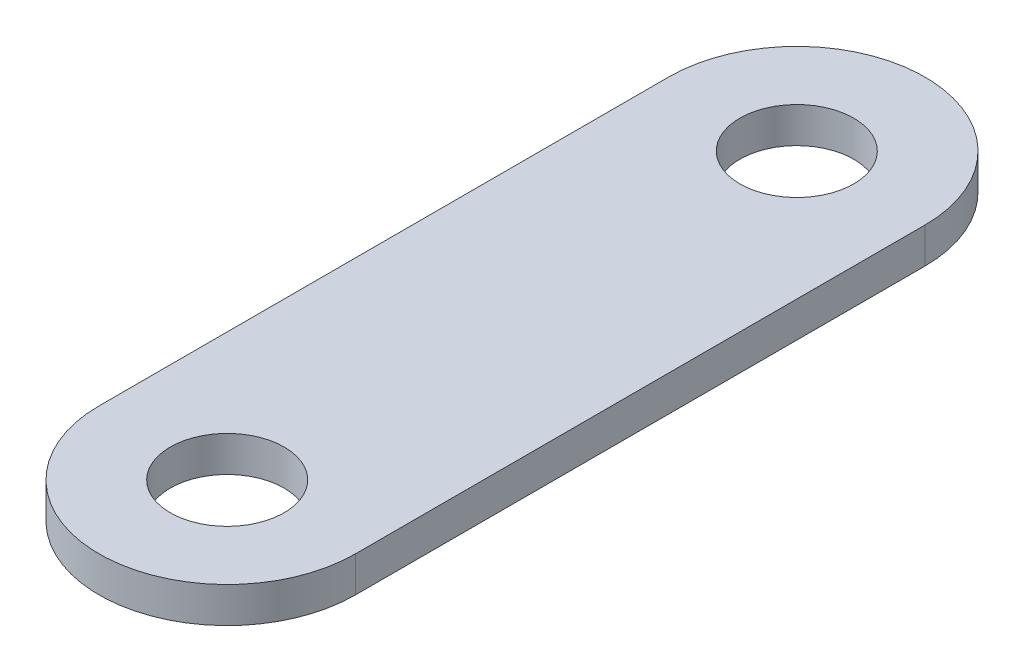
ISO-10303-21;
HEADER;
FILE_DESCRIPTION(('STEP AP214'),'2;1');
FILE_NAME('part.step','',(''),(''),'','','');
FILE_SCHEMA(('AUTOMOTIVE_DESIGN { 1 0 10303 214 1 1 1 1 }'));
ENDSEC;
DATA;
#1=APPLICATION_CONTEXT('core data for automotive mechanical design processes');
#2=APPLICATION_PROTOCOL_DEFINITION('international standard','automotive_design',2000,#1);
#3=PRODUCT_CONTEXT('',#1,'mechanical');
#4=PRODUCT('Part','Part','',(#3));
#5=PRODUCT_RELATED_PRODUCT_CATEGORY('part','',(#4));
#6=PRODUCT_DEFINITION_FORMATION('','',#4);
#7=PRODUCT_DEFINITION_CONTEXT('part definition',#1,'design');
#8=PRODUCT_DEFINITION('design','',#6,#7);
#9=PRODUCT_DEFINITION_SHAPE('','',#8);
#10=(LENGTH_UNIT() NAMED_UNIT(*) SI_UNIT(.MILLI.,.METRE.));
#11=(NAMED_UNIT(*) PLANE_ANGLE_UNIT() SI_UNIT($,.RADIAN.));
#12=(NAMED_UNIT(*) SI_UNIT($,.STERADIAN.) SOLID_ANGLE_UNIT());
#13=UNCERTAINTY_MEASURE_WITH_UNIT(LENGTH_MEASURE(1.E-05),#10,'distance_accuracy_value','');
#14=(GEOMETRIC_REPRESENTATION_CONTEXT(3) GLOBAL_UNCERTAINTY_ASSIGNED_CONTEXT((#13)) GLOBAL_UNIT_ASSIGNED_CONTEXT((#10,
#11,#12)) REPRESENTATION_CONTEXT('',''));
#15=CARTESIAN_POINT('',(0.,0.,0.));
#16=DIRECTION('',(0.,0.,1.));
#17=DIRECTION('',(1.,0.,0.));
#18=AXIS2_PLACEMENT_3D('',#15,#16,#17);
#19=CARTESIAN_POINT('',(0.,1.,-8.));
#20=DIRECTION('',(0.,-1.,0.));
#21=DIRECTION('',(0.,0.,-1.));
#22=AXIS2_PLACEMENT_3D('',#19,#20,#21);
#23=PLANE('',#22);
#24=CARTESIAN_POINT('',(0.,1.,-8.));
#25=DIRECTION('',(0.,1.,0.));
#26=DIRECTION('',(0.,0.,-1.));
#27=AXIS2_PLACEMENT_3D('',#24,#25,#26);
#28=CIRCLE('',#27,3.6);
#29=CARTESIAN_POINT('',(3.6,1.,-8.));
#30=VERTEX_POINT('',#29);
#31=CARTESIAN_POINT('',(-3.6,1.,-8.));
#32=VERTEX_POINT('',#31);
#33=EDGE_CURVE('E87',#30,#32,#28,.T.);
#34=ORIENTED_EDGE('',*,*,#33,.T.);
#35=DIRECTION('',(0.,0.,1.));
#36=VECTOR('',#35,1.);
#37=CARTESIAN_POINT('',(-3.6,1.,-8.));
#38=LINE('',#37,#36);
#39=CARTESIAN_POINT('',(-3.6,1.,8.));
#40=VERTEX_POINT('',#39);
#41=EDGE_CURVE('E115',#32,#40,#38,.T.);
#42=ORIENTED_EDGE('',*,*,#41,.T.);
#43=CARTESIAN_POINT('',(0.,1.,8.));
#44=DIRECTION('',(0.,-1.,0.));
#45=DIRECTION('',(0.,0.,1.));
#46=AXIS2_PLACEMENT_3D('',#43,#44,#45);
#47=CIRCLE('',#46,3.6);
#48=CARTESIAN_POINT('',(3.6,1.,8.));
#49=VERTEX_POINT('',#48);
#50=EDGE_CURVE('E94',#49,#40,#47,.T.);
#51=ORIENTED_EDGE('',*,*,#50,.F.);
#52=DIRECTION('',(0.,0.,-1.));
#53=VECTOR('',#52,1.);
#54=CARTESIAN_POINT('',(3.6,1.,-8.));
#55=LINE('',#54,#53);
#56=EDGE_CURVE('E54',#49,#30,#55,.T.);
#57=ORIENTED_EDGE('',*,*,#56,.T.);
#58=EDGE_LOOP('',(#34,#42,#51,#57));
#59=FACE_BOUND('',#58,.T.);
#60=CARTESIAN_POINT('',(0.,1.,-8.));
#61=DIRECTION('',(0.,1.,0.));
#62=DIRECTION('',(0.,0.,1.));
#63=AXIS2_PLACEMENT_3D('',#60,#61,#62);
#64=CIRCLE('',#63,1.6);
#65=CARTESIAN_POINT('',(0.,1.,-6.4));
#66=VERTEX_POINT('',#65);
#67=EDGE_CURVE('E109',#66,#66,#64,.T.);
#68=ORIENTED_EDGE('',*,*,#67,.F.);
#69=EDGE_LOOP('',(#68));
#70=FACE_BOUND('',#69,.T.);
#71=CARTESIAN_POINT('',(0.,1.,8.));
#72=DIRECTION('',(0.,-1.,0.));
#73=DIRECTION('',(0.,0.,-1.));
#74=AXIS2_PLACEMENT_3D('',#71,#72,#73);
#75=CIRCLE('',#74,1.6);
#76=CARTESIAN_POINT('',(0.,1.,6.4));
#77=VERTEX_POINT('',#76);
#78=EDGE_CURVE('E99',#77,#77,#75,.T.);
#79=ORIENTED_EDGE('',*,*,#78,.T.);
#80=EDGE_LOOP('',(#79));
#81=FACE_BOUND('',#80,.T.);
#82=ADVANCED_FACE('F37',(#59,#70,#81),#23,.F.);
#83=CARTESIAN_POINT('',(0.,0.,-8.));
#84=DIRECTION('',(0.,-1.,0.));
#85=DIRECTION('',(0.,0.,-1.));
#86=AXIS2_PLACEMENT_3D('',#83,#84,#85);
#87=PLANE('',#86);
#88=CARTESIAN_POINT('',(0.,0.,-8.));
#89=DIRECTION('',(0.,1.,0.));
#90=DIRECTION('',(0.,0.,-1.));
#91=AXIS2_PLACEMENT_3D('',#88,#89,#90);
#92=CIRCLE('',#91,3.6);
#93=CARTESIAN_POINT('',(3.6,0.,-8.));
#94=VERTEX_POINT('',#93);
#95=CARTESIAN_POINT('',(-3.6,0.,-8.));
#96=VERTEX_POINT('',#95);
#97=EDGE_CURVE('E85',#94,#96,#92,.T.);
#98=ORIENTED_EDGE('',*,*,#97,.F.);
#99=DIRECTION('',(0.,0.,-1.));
#100=VECTOR('',#99,1.);
#101=CARTESIAN_POINT('',(3.6,0.,-8.));
#102=LINE('',#101,#100);
#103=CARTESIAN_POINT('',(3.6,0.,8.));
#104=VERTEX_POINT('',#103);
#105=EDGE_CURVE('E79',#104,#94,#102,.T.);
#106=ORIENTED_EDGE('',*,*,#105,.F.);
#107=CARTESIAN_POINT('',(0.,0.,8.));
#108=DIRECTION('',(0.,-1.,0.));
#109=DIRECTION('',(0.,0.,1.));
#110=AXIS2_PLACEMENT_3D('',#107,#108,#109);
#111=CIRCLE('',#110,3.6);
#112=CARTESIAN_POINT('',(-3.6,0.,8.));
#113=VERTEX_POINT('',#112);
#114=EDGE_CURVE('E83',#104,#113,#111,.T.);
#115=ORIENTED_EDGE('',*,*,#114,.T.);
#116=DIRECTION('',(0.,0.,1.));
#117=VECTOR('',#116,1.);
#118=CARTESIAN_POINT('',(-3.6,0.,-8.));
#119=LINE('',#118,#117);
#120=EDGE_CURVE('E66',#96,#113,#119,.T.);
#121=ORIENTED_EDGE('',*,*,#120,.F.);
#122=EDGE_LOOP('',(#98,#106,#115,#121));
#123=FACE_BOUND('',#122,.T.);
#124=CARTESIAN_POINT('',(0.,0.,-8.));
#125=DIRECTION('',(0.,1.,0.));
#126=DIRECTION('',(0.,0.,1.));
#127=AXIS2_PLACEMENT_3D('',#124,#125,#126);
#128=CIRCLE('',#127,1.6);
#129=CARTESIAN_POINT('',(0.,0.,-6.4));
#130=VERTEX_POINT('',#129);
#131=EDGE_CURVE('E108',#130,#130,#128,.T.);
#132=ORIENTED_EDGE('',*,*,#131,.T.);
#133=EDGE_LOOP('',(#132));
#134=FACE_BOUND('',#133,.T.);
#135=CARTESIAN_POINT('',(0.,0.,8.));
#136=DIRECTION('',(0.,-1.,0.));
#137=DIRECTION('',(0.,0.,-1.));
#138=AXIS2_PLACEMENT_3D('',#135,#136,#137);
#139=CIRCLE('',#138,1.6);
#140=CARTESIAN_POINT('',(0.,0.,6.4));
#141=VERTEX_POINT('',#140);
#142=EDGE_CURVE('E103',#141,#141,#139,.T.);
#143=ORIENTED_EDGE('',*,*,#142,.F.);
#144=EDGE_LOOP('',(#143));
#145=FACE_BOUND('',#144,.T.);
#146=ADVANCED_FACE('F80',(#123,#134,#145),#87,.T.);
#147=CARTESIAN_POINT('',(0.,1.,-8.));
#148=DIRECTION('',(0.,-1.,0.));
#149=DIRECTION('',(0.,0.,-1.));
#150=AXIS2_PLACEMENT_3D('',#147,#148,#149);
#151=CYLINDRICAL_SURFACE('',#150,3.6);
#152=ORIENTED_EDGE('',*,*,#97,.T.);
#153=DIRECTION('',(0.,-1.,0.));
#154=VECTOR('',#153,1.);
#155=CARTESIAN_POINT('',(-3.6,1.,-8.));
#156=LINE('',#155,#154);
#157=EDGE_CURVE('E11',#32,#96,#156,.T.);
#158=ORIENTED_EDGE('',*,*,#157,.F.);
#159=ORIENTED_EDGE('',*,*,#33,.F.);
#160=DIRECTION('',(0.,-1.,0.));
#161=VECTOR('',#160,1.);
#162=CARTESIAN_POINT('',(3.6,1.,-8.));
#163=LINE('',#162,#161);
#164=EDGE_CURVE('E46',#30,#94,#163,.T.);
#165=ORIENTED_EDGE('',*,*,#164,.T.);
#166=EDGE_LOOP('',(#152,#158,#159,#165));
#167=FACE_BOUND('',#166,.T.);
#168=ADVANCED_FACE('F39',(#167),#151,.T.);
#169=CARTESIAN_POINT('',(-3.6,1.,-8.));
#170=DIRECTION('',(1.,0.,0.));
#171=DIRECTION('',(0.,0.,-1.));
#172=AXIS2_PLACEMENT_3D('',#169,#170,#171);
#173=PLANE('',#172);
#174=ORIENTED_EDGE('',*,*,#120,.T.);
#175=DIRECTION('',(0.,-1.,0.));
#176=VECTOR('',#175,1.);
#177=CARTESIAN_POINT('',(-3.6,1.,8.));
#178=LINE('',#177,#176);
#179=EDGE_CURVE('E93',#40,#113,#178,.T.);
#180=ORIENTED_EDGE('',*,*,#179,.F.);
#181=ORIENTED_EDGE('',*,*,#41,.F.);
#182=ORIENTED_EDGE('',*,*,#157,.T.);
#183=EDGE_LOOP('',(#174,#180,#181,#182));
#184=FACE_BOUND('',#183,.T.);
#185=ADVANCED_FACE('F124',(#184),#173,.F.);
#186=CARTESIAN_POINT('',(3.6,1.,-8.));
#187=DIRECTION('',(-1.,0.,0.));
#188=DIRECTION('',(0.,0.,1.));
#189=AXIS2_PLACEMENT_3D('',#186,#187,#188);
#190=PLANE('',#189);
#191=ORIENTED_EDGE('',*,*,#105,.T.);
#192=ORIENTED_EDGE('',*,*,#164,.F.);
#193=ORIENTED_EDGE('',*,*,#56,.F.);
#194=DIRECTION('',(0.,-1.,0.));
#195=VECTOR('',#194,1.);
#196=CARTESIAN_POINT('',(3.6,1.,8.));
#197=LINE('',#196,#195);
#198=EDGE_CURVE('E89',#49,#104,#197,.T.);
#199=ORIENTED_EDGE('',*,*,#198,.T.);
#200=EDGE_LOOP('',(#191,#192,#193,#199));
#201=FACE_BOUND('',#200,.T.);
#202=ADVANCED_FACE('F90',(#201),#190,.F.);
#203=CARTESIAN_POINT('',(0.,1.,-8.));
#204=DIRECTION('',(0.,-1.,0.));
#205=DIRECTION('',(0.,0.,-1.));
#206=AXIS2_PLACEMENT_3D('',#203,#204,#205);
#207=CYLINDRICAL_SURFACE('',#206,1.6);
#208=ORIENTED_EDGE('',*,*,#67,.T.);
#209=EDGE_LOOP('',(#208));
#210=FACE_BOUND('',#209,.T.);
#211=ORIENTED_EDGE('',*,*,#131,.F.);
#212=EDGE_LOOP('',(#211));
#213=FACE_BOUND('',#212,.T.);
#214=ADVANCED_FACE('F130',(#210,#213),#207,.F.);
#215=CARTESIAN_POINT('',(0.,1.,8.));
#216=DIRECTION('',(0.,-1.,0.));
#217=DIRECTION('',(0.,0.,1.));
#218=AXIS2_PLACEMENT_3D('',#215,#216,#217);
#219=CYLINDRICAL_SURFACE('',#218,3.6);
#220=ORIENTED_EDGE('',*,*,#114,.F.);
#221=ORIENTED_EDGE('',*,*,#198,.F.);
#222=ORIENTED_EDGE('',*,*,#50,.T.);
#223=ORIENTED_EDGE('',*,*,#179,.T.);
#224=EDGE_LOOP('',(#220,#221,#222,#223));
#225=FACE_BOUND('',#224,.T.);
#226=ADVANCED_FACE('F97',(#225),#219,.T.);
#227=CARTESIAN_POINT('',(0.,1.,8.));
#228=DIRECTION('',(0.,-1.,0.));
#229=DIRECTION('',(0.,0.,1.));
#230=AXIS2_PLACEMENT_3D('',#227,#228,#229);
#231=CYLINDRICAL_SURFACE('',#230,1.6);
#232=ORIENTED_EDGE('',*,*,#78,.F.);
#233=EDGE_LOOP('',(#232));
#234=FACE_BOUND('',#233,.T.);
#235=ORIENTED_EDGE('',*,*,#142,.T.);
#236=EDGE_LOOP('',(#235));
#237=FACE_BOUND('',#236,.T.);
#238=ADVANCED_FACE('F144',(#234,#237),#231,.F.);
#239=CLOSED_SHELL('',(#82,#146,#168,#185,#202,#214,#226,#238));
#240=MANIFOLD_SOLID_BREP('B2',#239);
#241=ADVANCED_BREP_SHAPE_REPRESENTATION('',(#18,#240),#14);
#242=SHAPE_DEFINITION_REPRESENTATION(#9,#241);
ENDSEC;
END-ISO-10303-21;
